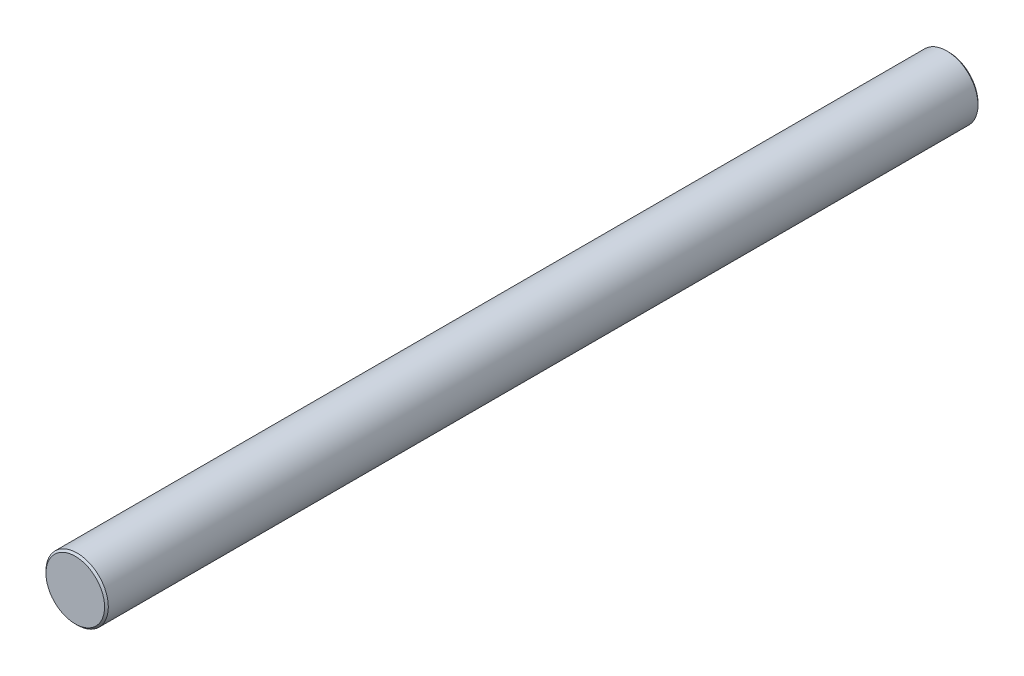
from build123d import *

# Parameters (mm, degrees)
SKETCH2_R      = 12.7
EXTRUDE2_DEPTH = 355.6
CHAMFER1_SIZE  = 0.762


with BuildPart() as part:
    # Sketch2 → Extrude2 (new body)
    with BuildSketch(Plane.XY):
        Circle(SKETCH2_R)
    extrude(amount=EXTRUDE2_DEPTH)

    # Chamfer1
    chamfer1_edges = [part.edges().sort_by_distance(p)[0] for p in [
        (-12.7, 0, 0),
        (-12.7, 0, 355.6),
    ]]
    chamfer(chamfer1_edges, length=CHAMFER1_SIZE)


solid = part.part
